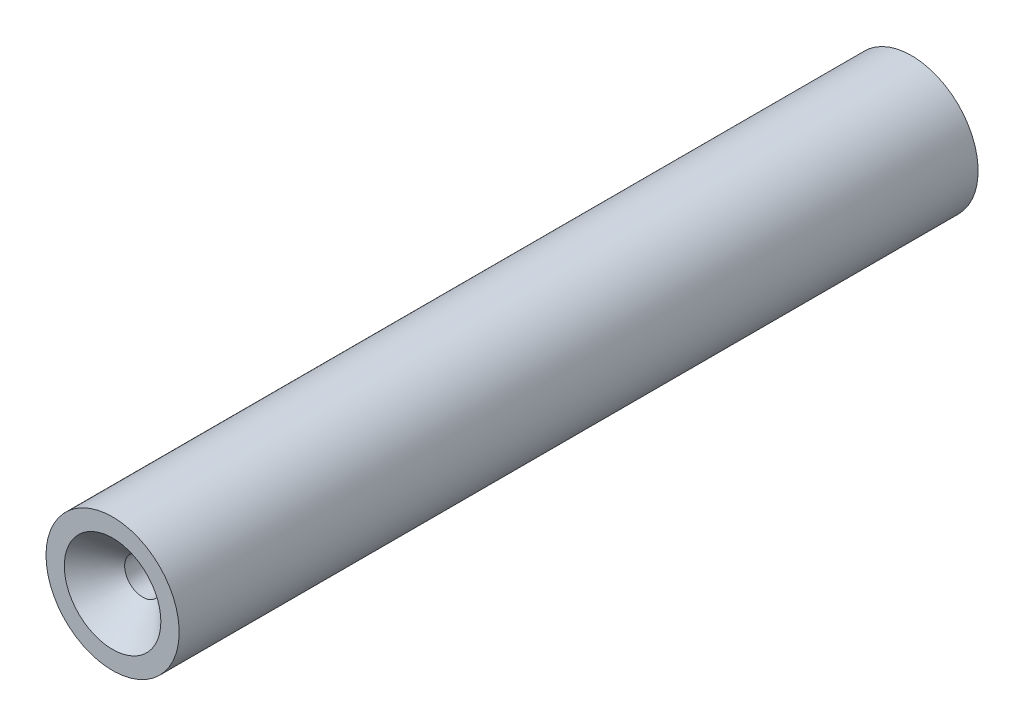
from build123d import *

# Parameters (mm, degrees)
SKETCH1_R                       = 6.35
BOSS_EXTRUDE2_DEPTH             = 76.2
F_8_32_TAPPED_HOLE1_D           = 3.4544
F_8_32_TAPPED_HOLE1_DEPTH       = 12.7
F_8_32_TAPPED_HOLE1_CSINK_D     = 9.2075
F_8_32_TAPPED_HOLE1_CSINK_ANGLE = 90
F_8_32_TAPPED_HOLE1_TIP         = 1.037806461


with BuildPart() as part:
    # Sketch1 → Boss-Extrude2 (new body)
    with BuildSketch(Plane.XY):
        with Locations(Location((-114.663209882, 59.989474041, 0), (0, 0, 180))):
            Circle(SKETCH1_R)
    extrude(amount=BOSS_EXTRUDE2_DEPTH)

    # 8-32 Tapped Hole1
    with Locations(Plane.XY.offset(76.2)):
        with Locations((-114.663209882, 59.989474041)):
            CounterSinkHole(F_8_32_TAPPED_HOLE1_D / 2, F_8_32_TAPPED_HOLE1_CSINK_D / 2, depth=F_8_32_TAPPED_HOLE1_DEPTH, counter_sink_angle=F_8_32_TAPPED_HOLE1_CSINK_ANGLE)
            with Locations((0, 0, -(F_8_32_TAPPED_HOLE1_DEPTH + F_8_32_TAPPED_HOLE1_TIP / 2))):  # 118° drill point
                Cone(0, F_8_32_TAPPED_HOLE1_D / 2, F_8_32_TAPPED_HOLE1_TIP, mode=Mode.SUBTRACT)


solid = part.part
